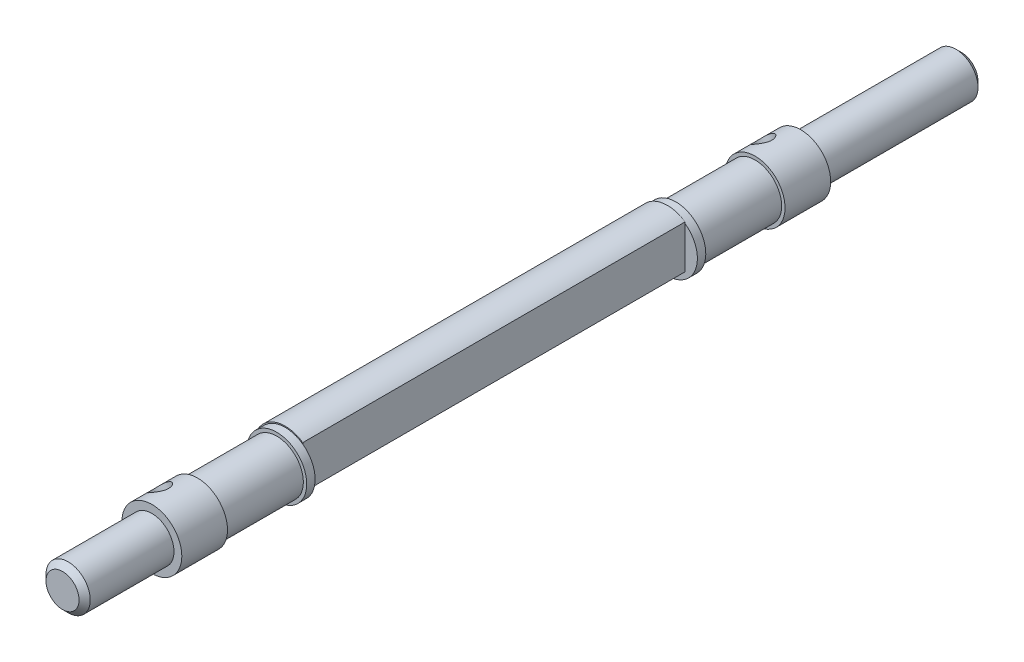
ISO-10303-21;
HEADER;
FILE_DESCRIPTION(('STEP AP214'),'2;1');
FILE_NAME('part.step','',(''),(''),'','','');
FILE_SCHEMA(('AUTOMOTIVE_DESIGN { 1 0 10303 214 1 1 1 1 }'));
ENDSEC;
DATA;
#1=APPLICATION_CONTEXT('core data for automotive mechanical design processes');
#2=APPLICATION_PROTOCOL_DEFINITION('international standard','automotive_design',2000,#1);
#3=PRODUCT_CONTEXT('',#1,'mechanical');
#4=PRODUCT('Part','Part','',(#3));
#5=PRODUCT_RELATED_PRODUCT_CATEGORY('part','',(#4));
#6=PRODUCT_DEFINITION_FORMATION('','',#4);
#7=PRODUCT_DEFINITION_CONTEXT('part definition',#1,'design');
#8=PRODUCT_DEFINITION('design','',#6,#7);
#9=PRODUCT_DEFINITION_SHAPE('','',#8);
#10=(LENGTH_UNIT() NAMED_UNIT(*) SI_UNIT(.MILLI.,.METRE.));
#11=(NAMED_UNIT(*) PLANE_ANGLE_UNIT() SI_UNIT($,.RADIAN.));
#12=(NAMED_UNIT(*) SI_UNIT($,.STERADIAN.) SOLID_ANGLE_UNIT());
#13=UNCERTAINTY_MEASURE_WITH_UNIT(LENGTH_MEASURE(1.E-05),#10,'distance_accuracy_value','');
#14=(GEOMETRIC_REPRESENTATION_CONTEXT(3) GLOBAL_UNCERTAINTY_ASSIGNED_CONTEXT((#13)) GLOBAL_UNIT_ASSIGNED_CONTEXT((#10,
#11,#12)) REPRESENTATION_CONTEXT('',''));
#15=CARTESIAN_POINT('',(0.,0.,0.));
#16=DIRECTION('',(0.,0.,1.));
#17=DIRECTION('',(1.,0.,0.));
#18=AXIS2_PLACEMENT_3D('',#15,#16,#17);
#19=CARTESIAN_POINT('',(-11.2332,-11.2332,81.));
#20=DIRECTION('',(0.,0.,1.));
#21=DIRECTION('',(1.,0.,0.));
#22=AXIS2_PLACEMENT_3D('',#19,#20,#21);
#23=PLANE('',#22);
#24=CARTESIAN_POINT('',(0.,0.,81.));
#25=DIRECTION('',(0.,0.,1.));
#26=DIRECTION('',(1.,0.,0.));
#27=AXIS2_PLACEMENT_3D('',#24,#25,#26);
#28=CIRCLE('',#27,10.7);
#29=CARTESIAN_POINT('',(-8.64869932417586,-6.3,81.));
#30=VERTEX_POINT('',#29);
#31=CARTESIAN_POINT('',(6.3,8.64869932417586,81.));
#32=VERTEX_POINT('',#31);
#33=EDGE_CURVE('E331',#30,#32,#28,.F.);
#34=ORIENTED_EDGE('',*,*,#33,.T.);
#35=DIRECTION('',(0.,-1.,0.));
#36=VECTOR('',#35,1.);
#37=CARTESIAN_POINT('',(6.3,15.819880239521,81.));
#38=LINE('',#37,#36);
#39=CARTESIAN_POINT('',(6.3,9.13892772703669,81.));
#40=VERTEX_POINT('',#39);
#41=EDGE_CURVE('E132',#40,#32,#38,.T.);
#42=ORIENTED_EDGE('',*,*,#41,.F.);
#43=CARTESIAN_POINT('',(0.,0.,81.));
#44=DIRECTION('',(0.,0.,-1.));
#45=DIRECTION('',(-1.,0.,0.));
#46=AXIS2_PLACEMENT_3D('',#43,#44,#45);
#47=CIRCLE('',#46,11.1);
#48=CARTESIAN_POINT('',(-9.13892772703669,-6.3,81.));
#49=VERTEX_POINT('',#48);
#50=EDGE_CURVE('E333',#40,#49,#47,.F.);
#51=ORIENTED_EDGE('',*,*,#50,.T.);
#52=DIRECTION('',(-1.,0.,0.));
#53=VECTOR('',#52,1.);
#54=CARTESIAN_POINT('',(6.3,-6.3,81.));
#55=LINE('',#54,#53);
#56=EDGE_CURVE('E137',#30,#49,#55,.T.);
#57=ORIENTED_EDGE('',*,*,#56,.F.);
#58=EDGE_LOOP('',(#34,#42,#51,#57));
#59=FACE_BOUND('',#58,.T.);
#60=ADVANCED_FACE('F41',(#59),#23,.T.);
#61=CARTESIAN_POINT('',(0.,0.,81.));
#62=DIRECTION('',(0.,0.,-1.));
#63=DIRECTION('',(-1.,0.,0.));
#64=AXIS2_PLACEMENT_3D('',#61,#62,#63);
#65=CYLINDRICAL_SURFACE('',#64,11.1);
#66=DIRECTION('',(0.,0.,-1.));
#67=VECTOR('',#66,1.);
#68=CARTESIAN_POINT('',(6.3,9.13892772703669,81.));
#69=LINE('',#68,#67);
#70=CARTESIAN_POINT('',(6.3,9.13892772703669,-55.5));
#71=VERTEX_POINT('',#70);
#72=EDGE_CURVE('E142',#71,#40,#69,.F.);
#73=ORIENTED_EDGE('',*,*,#72,.F.);
#74=CARTESIAN_POINT('',(0.,0.,-55.5));
#75=DIRECTION('',(0.,0.,-1.));
#76=DIRECTION('',(-1.,0.,0.));
#77=AXIS2_PLACEMENT_3D('',#74,#75,#76);
#78=CIRCLE('',#77,11.1);
#79=CARTESIAN_POINT('',(-9.13892772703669,-6.3,-55.5));
#80=VERTEX_POINT('',#79);
#81=EDGE_CURVE('E336',#80,#71,#78,.T.);
#82=ORIENTED_EDGE('',*,*,#81,.F.);
#83=DIRECTION('',(0.,0.,-1.));
#84=VECTOR('',#83,1.);
#85=CARTESIAN_POINT('',(-9.13892772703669,-6.3,81.));
#86=LINE('',#85,#84);
#87=EDGE_CURVE('E140',#49,#80,#86,.T.);
#88=ORIENTED_EDGE('',*,*,#87,.F.);
#89=ORIENTED_EDGE('',*,*,#50,.F.);
#90=EDGE_LOOP('',(#73,#82,#88,#89));
#91=FACE_BOUND('',#90,.T.);
#92=ADVANCED_FACE('F234',(#91),#65,.T.);
#93=CARTESIAN_POINT('',(11.2332,-11.2332,-55.5));
#94=DIRECTION('',(0.,0.,-1.));
#95=DIRECTION('',(-1.,0.,0.));
#96=AXIS2_PLACEMENT_3D('',#93,#94,#95);
#97=PLANE('',#96);
#98=ORIENTED_EDGE('',*,*,#81,.T.);
#99=DIRECTION('',(0.,-1.,0.));
#100=VECTOR('',#99,1.);
#101=CARTESIAN_POINT('',(6.3,15.819880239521,-55.5));
#102=LINE('',#101,#100);
#103=CARTESIAN_POINT('',(6.3,8.64869932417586,-55.5));
#104=VERTEX_POINT('',#103);
#105=EDGE_CURVE('E127',#71,#104,#102,.T.);
#106=ORIENTED_EDGE('',*,*,#105,.T.);
#107=CARTESIAN_POINT('',(0.,0.,-55.5));
#108=DIRECTION('',(0.,0.,-1.));
#109=DIRECTION('',(0.,1.,0.));
#110=AXIS2_PLACEMENT_3D('',#107,#108,#109);
#111=CIRCLE('',#110,10.7);
#112=CARTESIAN_POINT('',(-8.64869932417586,-6.3,-55.5));
#113=VERTEX_POINT('',#112);
#114=EDGE_CURVE('E339',#104,#113,#111,.F.);
#115=ORIENTED_EDGE('',*,*,#114,.T.);
#116=DIRECTION('',(-1.,0.,0.));
#117=VECTOR('',#116,1.);
#118=CARTESIAN_POINT('',(6.3,-6.3,-55.5));
#119=LINE('',#118,#117);
#120=EDGE_CURVE('E130',#113,#80,#119,.T.);
#121=ORIENTED_EDGE('',*,*,#120,.T.);
#122=EDGE_LOOP('',(#98,#106,#115,#121));
#123=FACE_BOUND('',#122,.T.);
#124=ADVANCED_FACE('F241',(#123),#97,.T.);
#125=CARTESIAN_POINT('',(0.,0.,112.3));
#126=DIRECTION('',(0.,0.,1.));
#127=DIRECTION('',(1.,0.,0.));
#128=AXIS2_PLACEMENT_3D('',#125,#126,#127);
#129=CYLINDRICAL_SURFACE('',#128,10.7);
#130=CARTESIAN_POINT('',(-8.01720753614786,7.08621078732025,120.45000000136));
#131=CARTESIAN_POINT('',(-8.01720712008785,7.08621157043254,120.542779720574));
#132=CARTESIAN_POINT('',(-8.01455246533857,7.08921896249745,120.63556517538));
#133=CARTESIAN_POINT('',(-8.00395107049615,7.10118428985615,120.820458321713));
#134=CARTESIAN_POINT('',(-7.99600218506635,7.11014463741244,120.912565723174));
#135=CARTESIAN_POINT('',(-7.9642128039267,7.14579737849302,121.187084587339));
#136=CARTESIAN_POINT('',(-7.93242960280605,7.18126122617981,121.367577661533));
#137=CARTESIAN_POINT('',(-7.84832169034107,7.27307684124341,121.717510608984));
#138=CARTESIAN_POINT('',(-7.79604652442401,7.32937820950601,121.886976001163));
#139=CARTESIAN_POINT('',(-7.6716353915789,7.45949653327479,122.211208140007));
#140=CARTESIAN_POINT('',(-7.59950186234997,7.53331133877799,122.36597668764));
#141=CARTESIAN_POINT('',(-7.43351200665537,7.69720098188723,122.661963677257));
#142=CARTESIAN_POINT('',(-7.33902833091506,7.78772465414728,122.8025816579));
#143=CARTESIAN_POINT('',(-7.13080570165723,7.97881913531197,123.060920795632));
#144=CARTESIAN_POINT('',(-7.01706296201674,8.07939191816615,123.178637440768));
#145=CARTESIAN_POINT('',(-6.76897529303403,8.28841677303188,123.390474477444));
#146=CARTESIAN_POINT('',(-6.63420993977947,8.39699827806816,123.48397709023));
#147=CARTESIAN_POINT('',(-6.34862680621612,8.61493723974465,123.640659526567));
#148=CARTESIAN_POINT('',(-6.197813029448,8.72429449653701,123.703846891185));
#149=CARTESIAN_POINT('',(-5.88875860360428,8.93568351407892,123.796101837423));
#150=CARTESIAN_POINT('',(-5.73090736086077,9.03783765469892,123.826191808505));
#151=CARTESIAN_POINT('',(-5.40791009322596,9.23473046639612,123.854640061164));
#152=CARTESIAN_POINT('',(-5.242765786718,9.32947086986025,123.853005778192));
#153=CARTESIAN_POINT('',(-4.91623765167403,9.50546188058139,123.818718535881));
#154=CARTESIAN_POINT('',(-4.7549299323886,9.58707323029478,123.787174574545));
#155=CARTESIAN_POINT('',(-4.43512043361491,9.73915180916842,123.695786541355));
#156=CARTESIAN_POINT('',(-4.27661885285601,9.80961825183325,123.635940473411));
#157=CARTESIAN_POINT('',(-3.96526354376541,9.93959387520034,123.488948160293));
#158=CARTESIAN_POINT('',(-3.81250521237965,9.99895503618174,123.401469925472));
#159=CARTESIAN_POINT('',(-3.51938507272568,10.1058549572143,123.201972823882));
#160=CARTESIAN_POINT('',(-3.37902580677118,10.1533912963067,123.089948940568));
#161=CARTESIAN_POINT('',(-3.10936553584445,10.239274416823,122.838878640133));
#162=CARTESIAN_POINT('',(-2.98079638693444,10.2771399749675,122.698879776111));
#163=CARTESIAN_POINT('',(-2.74641347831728,10.3422457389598,122.398716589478));
#164=CARTESIAN_POINT('',(-2.64061058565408,10.3694808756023,122.23854269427));
#165=CARTESIAN_POINT('',(-2.45491343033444,10.4150238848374,121.899788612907));
#166=CARTESIAN_POINT('',(-2.3753628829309,10.4332147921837,121.721001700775));
#167=CARTESIAN_POINT('',(-2.27986345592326,10.4543412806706,121.444535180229));
#168=CARTESIAN_POINT('',(-2.2520085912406,10.460355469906,121.351042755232));
#169=CARTESIAN_POINT('',(-2.20452729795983,10.4704660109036,121.161901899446));
#170=CARTESIAN_POINT('',(-2.18489707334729,10.4745632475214,121.066254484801));
#171=CARTESIAN_POINT('',(-2.15580959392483,10.4805857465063,120.884006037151));
#172=CARTESIAN_POINT('',(-2.14548006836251,10.4826983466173,120.797548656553));
#173=CARTESIAN_POINT('',(-2.13169223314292,10.4855108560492,120.624062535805));
#174=CARTESIAN_POINT('',(-2.12823395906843,10.4862107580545,120.5370337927));
#175=CARTESIAN_POINT('',(-2.12823567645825,10.4862108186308,120.357220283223));
#176=CARTESIAN_POINT('',(-2.13216748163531,10.4854155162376,120.264434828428));
#177=CARTESIAN_POINT('',(-2.14783045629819,10.4822171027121,120.079541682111));
#178=CARTESIAN_POINT('',(-2.15956478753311,10.479813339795,119.987434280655));
#179=CARTESIAN_POINT('',(-2.20633565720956,10.4701092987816,119.712915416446));
#180=CARTESIAN_POINT('',(-2.252939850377,10.4603161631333,119.532422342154));
#181=CARTESIAN_POINT('',(-2.3745084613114,10.4333843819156,119.182489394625));
#182=CARTESIAN_POINT('',(-2.44940445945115,10.4162634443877,119.013024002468));
#183=CARTESIAN_POINT('',(-2.62429579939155,10.3735794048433,118.688791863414));
#184=CARTESIAN_POINT('',(-2.7242880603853,10.3480173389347,118.534023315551));
#185=CARTESIAN_POINT('',(-2.94921558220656,10.2862107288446,118.238036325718));
#186=CARTESIAN_POINT('',(-3.07485321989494,10.2496473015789,118.097418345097));
#187=CARTESIAN_POINT('',(-3.34445720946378,10.1648684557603,117.839079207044));
#188=CARTESIAN_POINT('',(-3.48842716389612,10.1166507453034,117.721362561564));
#189=CARTESIAN_POINT('',(-3.79349183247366,10.0063129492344,117.509525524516));
#190=CARTESIAN_POINT('',(-3.95490885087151,9.9438934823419,117.416022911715));
#191=CARTESIAN_POINT('',(-4.28644109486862,9.80554071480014,117.259340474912));
#192=CARTESIAN_POINT('',(-4.45655414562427,9.72961078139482,117.196153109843));
#193=CARTESIAN_POINT('',(-4.79414961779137,9.56765630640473,117.103898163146));
#194=CARTESIAN_POINT('',(-4.9615433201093,9.48203019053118,117.073808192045));
#195=CARTESIAN_POINT('',(-5.29355613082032,9.30075275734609,117.045359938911));
#196=CARTESIAN_POINT('',(-5.45817588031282,9.20510379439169,117.046994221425));
#197=CARTESIAN_POINT('',(-5.77385263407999,9.01031763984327,117.081281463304));
#198=CARTESIAN_POINT('',(-5.92518399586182,8.91142673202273,117.112825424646));
#199=CARTESIAN_POINT('',(-6.21679265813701,8.71050287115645,117.204213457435));
#200=CARTESIAN_POINT('',(-6.35706917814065,8.60846969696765,117.264059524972));
#201=CARTESIAN_POINT('',(-6.62530902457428,8.40381590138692,117.411051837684));
#202=CARTESIAN_POINT('',(-6.75309646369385,8.30120388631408,117.498530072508));
#203=CARTESIAN_POINT('',(-6.9922345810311,8.10080435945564,117.698027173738));
#204=CARTESIAN_POINT('',(-7.10358189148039,8.00301783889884,117.81005105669));
#205=CARTESIAN_POINT('',(-7.3127889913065,7.81242675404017,118.061121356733));
#206=CARTESIAN_POINT('',(-7.40986610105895,7.72001538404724,118.201120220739));
#207=CARTESIAN_POINT('',(-7.58344080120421,7.54958671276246,118.501283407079));
#208=CARTESIAN_POINT('',(-7.65992856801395,7.47157628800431,118.661457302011));
#209=CARTESIAN_POINT('',(-7.79221854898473,7.33352933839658,119.000211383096));
#210=CARTESIAN_POINT('',(-7.8477476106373,7.27373199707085,119.178998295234));
#211=CARTESIAN_POINT('',(-7.91379340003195,7.2015903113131,119.455464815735));
#212=CARTESIAN_POINT('',(-7.93292927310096,7.18047438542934,119.548957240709));
#213=CARTESIAN_POINT('',(-7.96542590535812,7.14440964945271,119.738098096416));
#214=CARTESIAN_POINT('',(-7.97878932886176,7.12945799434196,119.833745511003));
#215=CARTESIAN_POINT('',(-7.99854870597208,7.10727874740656,120.01599395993));
#216=CARTESIAN_POINT('',(-8.00554303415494,7.0993894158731,120.102451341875));
#217=CARTESIAN_POINT('',(-8.01487265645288,7.08885505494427,120.275937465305));
#218=CARTESIAN_POINT('',(-8.01720792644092,7.08621005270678,120.362966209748));
#219=CARTESIAN_POINT('',(-8.01720753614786,7.08621078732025,120.45000000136));
#220=B_SPLINE_CURVE_WITH_KNOTS('',3,(#130,#131,#132,#133,#134,#135,#136,#137,#138,#139,#140,
#141,#142,#143,#144,#145,#146,#147,#148,#149,#150,#151,#152,#153,#154,#155,#156,#157,#158,#159,
#160,#161,#162,#163,#164,#165,#166,#167,#168,#169,#170,#171,#172,#173,#174,#175,#176,#177,#178,
#179,#180,#181,#182,#183,#184,#185,#186,#187,#188,#189,#190,#191,#192,#193,#194,#195,#196,#197,
#198,#199,#200,#201,#202,#203,#204,#205,#206,#207,#208,#209,#210,#211,#212,#213,#214,#215,#216,
#217,#218,#219),.UNSPECIFIED.,.T.,.F.,(4,2,2,2,2,2,2,2,2,2,2,2,2,2,2,2,2,2,2,2,2,2,2,2,2,2,2,2,
2,2,2,2,2,2,2,2,2,2,2,2,2,2,2,2,4),(0.,0.27825205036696,0.556616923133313,1.11368727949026,
1.66941897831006,2.22508248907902,2.79872517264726,3.37248075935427,3.95968527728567,
4.54674364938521,5.11510863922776,5.68334041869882,6.23129456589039,6.77928736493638,
7.33413195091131,7.88909003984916,8.46783511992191,9.04685584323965,9.63318173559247,
9.92608014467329,10.2188432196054,10.4798615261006,10.7408811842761,11.0191332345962,
11.2974981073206,11.8545684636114,12.4103001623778,12.9659636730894,13.5396063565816,
14.1133619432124,14.7005664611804,15.2876248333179,15.8559898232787,16.4242216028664,
16.9721757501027,17.5201685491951,18.0750131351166,18.6299712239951,19.2087163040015,
19.7877370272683,20.3740629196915,20.6669613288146,20.9597244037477,21.220742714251,
21.4817623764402),.UNSPECIFIED.);
#221=CARTESIAN_POINT('',(-8.01720753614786,7.08621078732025,120.45000000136));
#222=VERTEX_POINT('',#221);
#223=EDGE_CURVE('E162',#222,#222,#220,.T.);
#224=ORIENTED_EDGE('',*,*,#223,.F.);
#225=EDGE_LOOP('',(#224));
#226=FACE_BOUND('',#225,.T.);
#227=CARTESIAN_POINT('',(0.,0.,112.3));
#228=DIRECTION('',(0.,0.,1.));
#229=DIRECTION('',(1.,0.,0.));
#230=AXIS2_PLACEMENT_3D('',#227,#228,#229);
#231=CIRCLE('',#230,10.7);
#232=CARTESIAN_POINT('',(10.7,0.,112.3));
#233=VERTEX_POINT('',#232);
#234=EDGE_CURVE('E298',#233,#233,#231,.T.);
#235=ORIENTED_EDGE('',*,*,#234,.T.);
#236=EDGE_LOOP('',(#235));
#237=FACE_BOUND('',#236,.T.);
#238=CARTESIAN_POINT('',(0.,0.,128.6));
#239=DIRECTION('',(0.,0.,1.));
#240=DIRECTION('',(1.,0.,0.));
#241=AXIS2_PLACEMENT_3D('',#238,#239,#240);
#242=CIRCLE('',#241,10.7);
#243=CARTESIAN_POINT('',(10.7,0.,128.6));
#244=VERTEX_POINT('',#243);
#245=EDGE_CURVE('E149',#244,#244,#242,.T.);
#246=ORIENTED_EDGE('',*,*,#245,.F.);
#247=EDGE_LOOP('',(#246));
#248=FACE_BOUND('',#247,.T.);
#249=ADVANCED_FACE('F251',(#226,#237,#248),#129,.T.);
#250=CARTESIAN_POINT('',(0.,0.,-86.8));
#251=DIRECTION('',(0.,0.,-1.));
#252=DIRECTION('',(0.,1.,0.));
#253=AXIS2_PLACEMENT_3D('',#250,#251,#252);
#254=CYLINDRICAL_SURFACE('',#253,10.7);
#255=CARTESIAN_POINT('',(-2.12823479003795,10.4862107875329,-94.9500000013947));
#256=CARTESIAN_POINT('',(-2.12823567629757,10.4862108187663,-95.0427797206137));
#257=CARTESIAN_POINT('',(-2.13216748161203,10.4854155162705,-95.1355651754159));
#258=CARTESIAN_POINT('',(-2.14783045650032,10.4822171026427,-95.3204583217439));
#259=CARTESIAN_POINT('',(-2.15956478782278,10.4798133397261,-95.4125657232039));
#260=CARTESIAN_POINT('',(-2.20633565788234,10.4701092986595,-95.6870845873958));
#261=CARTESIAN_POINT('',(-2.25293985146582,10.4603161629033,-95.867577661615));
#262=CARTESIAN_POINT('',(-2.37450846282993,10.4333843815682,-96.2175106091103));
#263=CARTESIAN_POINT('',(-2.44940446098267,10.416263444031,-96.3869760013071));
#264=CARTESIAN_POINT('',(-2.62429580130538,10.3735794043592,-96.7112081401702));
#265=CARTESIAN_POINT('',(-2.72428806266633,10.3480173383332,-96.8659766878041));
#266=CARTESIAN_POINT('',(-2.94921558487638,10.286210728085,-97.1619636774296));
#267=CARTESIAN_POINT('',(-3.07485322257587,10.2496473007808,-97.3025816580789));
#268=CARTESIAN_POINT('',(-3.34445721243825,10.1648684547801,-97.5609207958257));
#269=CARTESIAN_POINT('',(-3.48842716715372,10.1166507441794,-97.6786374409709));
#270=CARTESIAN_POINT('',(-3.79349183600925,10.0063129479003,-97.89047447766));
#271=CARTESIAN_POINT('',(-3.95490885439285,9.94389348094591,-97.9839770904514));
#272=CARTESIAN_POINT('',(-4.28644109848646,9.805540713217,-98.1406595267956));
#273=CARTESIAN_POINT('',(-4.4565541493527,9.7296107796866,-98.2038468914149));
#274=CARTESIAN_POINT('',(-4.79414962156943,9.56765630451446,-98.2961018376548));
#275=CARTESIAN_POINT('',(-4.96154332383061,9.48203018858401,-98.3261918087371));
#276=CARTESIAN_POINT('',(-5.29355613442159,9.30075275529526,-98.3546400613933));
#277=CARTESIAN_POINT('',(-5.45817588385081,9.20510379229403,-98.3530057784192));
#278=CARTESIAN_POINT('',(-5.77385263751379,9.010317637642,-98.3187185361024));
#279=CARTESIAN_POINT('',(-5.92518399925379,8.9114267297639,-98.2871745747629));
#280=CARTESIAN_POINT('',(-6.21679266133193,8.71050286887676,-98.195786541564));
#281=CARTESIAN_POINT('',(-6.3570691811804,8.60846969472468,-98.1359404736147));
#282=CARTESIAN_POINT('',(-6.62530902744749,8.40381589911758,-97.9889481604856));
#283=CARTESIAN_POINT('',(-6.75309646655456,8.30120388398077,-97.9014699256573));
#284=CARTESIAN_POINT('',(-6.99223458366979,8.10080435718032,-97.7019728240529));
#285=CARTESIAN_POINT('',(-7.10358189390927,8.0030178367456,-97.5899489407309));
#286=CARTESIAN_POINT('',(-7.31278899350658,7.81242675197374,-97.3388786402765));
#287=CARTESIAN_POINT('',(-7.40986610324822,7.72001538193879,-97.198879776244));
#288=CARTESIAN_POINT('',(-7.58344080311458,7.54958671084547,-96.8987165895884));
#289=CARTESIAN_POINT('',(-7.65992856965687,7.47157628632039,-96.7385426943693));
#290=CARTESIAN_POINT('',(-7.79221855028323,7.33352933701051,-96.3997886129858));
#291=CARTESIAN_POINT('',(-7.8477476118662,7.27373199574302,-96.2210017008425));
#292=CARTESIAN_POINT('',(-7.91379340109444,7.20159031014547,-95.9445351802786));
#293=CARTESIAN_POINT('',(-7.93292927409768,7.1804743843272,-95.8510427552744));
#294=CARTESIAN_POINT('',(-7.96542590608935,7.14440964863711,-95.6619018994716));
#295=CARTESIAN_POINT('',(-7.97878932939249,7.12945799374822,-95.5662544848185));
#296=CARTESIAN_POINT('',(-7.99854870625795,7.10727874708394,-95.3840060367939));
#297=CARTESIAN_POINT('',(-8.0055430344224,7.0993894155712,-95.2975486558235));
#298=CARTESIAN_POINT('',(-8.01487265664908,7.08885505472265,-95.1240625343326));
#299=CARTESIAN_POINT('',(-8.01720792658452,7.08621005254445,-95.0370337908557));
#300=CARTESIAN_POINT('',(-8.01720712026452,7.08621157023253,-94.8572202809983));
#301=CARTESIAN_POINT('',(-8.0145524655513,7.08921896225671,-94.7644348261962));
#302=CARTESIAN_POINT('',(-8.00395107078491,7.10118428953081,-94.5795416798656));
#303=CARTESIAN_POINT('',(-7.99600218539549,7.11014463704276,-94.4874342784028));
#304=CARTESIAN_POINT('',(-7.96421280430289,7.14579737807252,-94.2129154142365));
#305=CARTESIAN_POINT('',(-7.93242960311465,7.18126122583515,-94.032422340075));
#306=CARTESIAN_POINT('',(-7.84832169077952,7.27307684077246,-93.6824893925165));
#307=CARTESIAN_POINT('',(-7.79604652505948,7.32937820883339,-93.5130240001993));
#308=CARTESIAN_POINT('',(-7.67163539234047,7.45949653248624,-93.1887918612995));
#309=CARTESIAN_POINT('',(-7.59950186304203,7.53331133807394,-93.0340233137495));
#310=CARTESIAN_POINT('',(-7.43351200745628,7.69720098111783,-92.7380363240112));
#311=CARTESIAN_POINT('',(-7.33902833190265,7.7877246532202,-92.597418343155));
#312=CARTESIAN_POINT('',(-7.13080570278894,7.97881913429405,-92.339079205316));
#313=CARTESIAN_POINT('',(-7.01706296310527,8.07939191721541,-92.2213625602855));
#314=CARTESIAN_POINT('',(-6.76897529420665,8.28841677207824,-92.0095255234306));
#315=CARTESIAN_POINT('',(-6.63420994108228,8.39699827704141,-91.9160229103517));
#316=CARTESIAN_POINT('',(-6.34862680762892,8.61493723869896,-91.7593404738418));
#317=CARTESIAN_POINT('',(-6.19781303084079,8.72429449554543,-91.6961531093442));
#318=CARTESIAN_POINT('',(-5.88875860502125,8.93568351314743,-91.6038981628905));
#319=CARTESIAN_POINT('',(-5.73090736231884,9.03783765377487,-91.573808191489));
#320=CARTESIAN_POINT('',(-5.40791009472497,9.23473046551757,-91.545359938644));
#321=CARTESIAN_POINT('',(-5.24276578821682,9.32947086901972,-91.5469942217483));
#322=CARTESIAN_POINT('',(-4.91623765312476,9.50546187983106,-91.5812814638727));
#323=CARTESIAN_POINT('',(-4.7549299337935,9.58707322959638,-91.6128254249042));
#324=CARTESIAN_POINT('',(-4.43512043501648,9.73915180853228,-91.7042134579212));
#325=CARTESIAN_POINT('',(-4.27661885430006,9.80961825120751,-91.7640595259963));
#326=CARTESIAN_POINT('',(-3.96526354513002,9.93959387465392,-91.9110518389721));
#327=CARTESIAN_POINT('',(-3.81250521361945,9.99895503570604,-91.9985300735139));
#328=CARTESIAN_POINT('',(-3.51938507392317,10.1058549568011,-92.1980271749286));
#329=CARTESIAN_POINT('',(-3.37902580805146,10.1533912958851,-92.3100510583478));
#330=CARTESIAN_POINT('',(-3.1093655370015,10.2392744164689,-92.5611213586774));
#331=CARTESIAN_POINT('',(-2.98079638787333,10.2771399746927,-92.701120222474));
#332=CARTESIAN_POINT('',(-2.74641347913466,10.3422457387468,-93.0012834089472));
#333=CARTESIAN_POINT('',(-2.64061058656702,10.3694808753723,-93.1614573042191));
#334=CARTESIAN_POINT('',(-2.4549134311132,10.4150238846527,-93.5002113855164));
#335=CARTESIAN_POINT('',(-2.37536288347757,10.4332147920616,-93.6789982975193));
#336=CARTESIAN_POINT('',(-2.27986345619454,10.4543412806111,-93.9554648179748));
#337=CARTESIAN_POINT('',(-2.25200859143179,10.4603554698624,-94.0489572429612));
#338=CARTESIAN_POINT('',(-2.2045272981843,10.4704660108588,-94.2380980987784));
#339=CARTESIAN_POINT('',(-2.18489707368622,10.4745632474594,-94.3337455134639));
#340=CARTESIAN_POINT('',(-2.1558095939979,10.4805857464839,-94.5159939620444));
#341=CARTESIAN_POINT('',(-2.14548006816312,10.4826983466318,-94.602451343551));
#342=CARTESIAN_POINT('',(-2.13169223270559,10.4855108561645,-94.7759374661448));
#343=CARTESIAN_POINT('',(-2.12823395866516,10.4862107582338,-94.8629662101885));
#344=CARTESIAN_POINT('',(-2.12823479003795,10.4862107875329,-94.9500000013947));
#345=B_SPLINE_CURVE_WITH_KNOTS('',3,(#255,#256,#257,#258,#259,#260,#261,#262,#263,#264,#265,
#266,#267,#268,#269,#270,#271,#272,#273,#274,#275,#276,#277,#278,#279,#280,#281,#282,#283,#284,
#285,#286,#287,#288,#289,#290,#291,#292,#293,#294,#295,#296,#297,#298,#299,#300,#301,#302,#303,
#304,#305,#306,#307,#308,#309,#310,#311,#312,#313,#314,#315,#316,#317,#318,#319,#320,#321,#322,
#323,#324,#325,#326,#327,#328,#329,#330,#331,#332,#333,#334,#335,#336,#337,#338,#339,#340,#341,
#342,#343,#344),.UNSPECIFIED.,.T.,.F.,(4,2,2,2,2,2,2,2,2,2,2,2,2,2,2,2,2,2,2,2,2,2,2,2,2,2,2,2,
2,2,2,2,2,2,2,2,2,2,2,2,2,2,2,2,4),(0.,0.278252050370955,0.556616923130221,1.11368727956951,
1.66941897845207,2.22508248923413,2.79872517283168,3.37248075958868,3.95968527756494,
4.54674364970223,5.11510863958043,5.68334041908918,6.23129456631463,6.77928736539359,
7.33413195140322,7.88909004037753,8.46783512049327,9.04685584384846,9.63318173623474,
9.9260801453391,10.2188432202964,10.4798615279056,10.7408811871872,11.0191332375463,
11.2974981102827,11.854568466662,12.4103001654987,12.9659636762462,13.5396063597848,
14.1133619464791,14.7005664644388,15.2876248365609,15.8559898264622,16.4242216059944,
16.9721757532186,17.5201685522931,18.0750131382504,18.6299712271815,19.2087163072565,
19.7877370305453,20.3740629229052,20.6669613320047,20.9597244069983,21.2207427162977,
21.4817623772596),.UNSPECIFIED.);
#346=CARTESIAN_POINT('',(-2.12823479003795,10.4862107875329,-94.9500000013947));
#347=VERTEX_POINT('',#346);
#348=EDGE_CURVE('E157',#347,#347,#345,.T.);
#349=ORIENTED_EDGE('',*,*,#348,.F.);
#350=EDGE_LOOP('',(#349));
#351=FACE_BOUND('',#350,.T.);
#352=CARTESIAN_POINT('',(0.,0.,-86.8));
#353=DIRECTION('',(0.,0.,-1.));
#354=DIRECTION('',(0.,1.,0.));
#355=AXIS2_PLACEMENT_3D('',#352,#353,#354);
#356=CIRCLE('',#355,10.7);
#357=CARTESIAN_POINT('',(0.,10.7,-86.8));
#358=VERTEX_POINT('',#357);
#359=EDGE_CURVE('E158',#358,#358,#356,.F.);
#360=ORIENTED_EDGE('',*,*,#359,.F.);
#361=EDGE_LOOP('',(#360));
#362=FACE_BOUND('',#361,.T.);
#363=CARTESIAN_POINT('',(0.,0.,-103.1));
#364=DIRECTION('',(0.,0.,-1.));
#365=DIRECTION('',(-1.,0.,0.));
#366=AXIS2_PLACEMENT_3D('',#363,#364,#365);
#367=CIRCLE('',#366,10.7);
#368=CARTESIAN_POINT('',(-10.7,0.,-103.1));
#369=VERTEX_POINT('',#368);
#370=EDGE_CURVE('E153',#369,#369,#367,.T.);
#371=ORIENTED_EDGE('',*,*,#370,.F.);
#372=EDGE_LOOP('',(#371));
#373=FACE_BOUND('',#372,.T.);
#374=ADVANCED_FACE('F171',(#351,#362,#373),#254,.T.);
#375=CARTESIAN_POINT('',(0.971463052,-1.682623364,120.45));
#376=DIRECTION('',(-0.500000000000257,0.86602540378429,0.));
#377=DIRECTION('',(-0.86602540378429,-0.500000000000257,0.));
#378=AXIS2_PLACEMENT_3D('',#375,#376,#377);
#379=CONICAL_SURFACE('',#378,0.,1.02974425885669);
#380=CARTESIAN_POINT('',(0.97146305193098,-1.6826233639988,120.45));
#381=VERTEX_POINT('',#380);
#382=VERTEX_LOOP('',#381);
#383=FACE_BOUND('',#382,.T.);
#384=CARTESIAN_POINT('',(-0.0499999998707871,0.0866025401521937,120.45));
#385=DIRECTION('',(-0.50000000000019,0.866025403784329,0.));
#386=DIRECTION('',(-0.866025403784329,-0.500000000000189,0.));
#387=AXIS2_PLACEMENT_3D('',#384,#385,#386);
#388=CIRCLE('',#387,3.4000000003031);
#389=CARTESIAN_POINT('',(-2.994486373,-1.61339746,120.45));
#390=VERTEX_POINT('',#389);
#391=EDGE_CURVE('E159',#390,#390,#388,.F.);
#392=ORIENTED_EDGE('',*,*,#391,.F.);
#393=EDGE_LOOP('',(#392));
#394=FACE_BOUND('',#393,.T.);
#395=ADVANCED_FACE('F185',(#383,#394),#379,.F.);
#396=CARTESIAN_POINT('',(-0.0499999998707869,0.086602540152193,120.45));
#397=DIRECTION('',(-0.500000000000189,0.866025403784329,0.));
#398=DIRECTION('',(-0.866025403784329,-0.500000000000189,0.));
#399=AXIS2_PLACEMENT_3D('',#396,#397,#398);
#400=CYLINDRICAL_SURFACE('',#399,3.40000000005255);
#401=ORIENTED_EDGE('',*,*,#391,.T.);
#402=EDGE_LOOP('',(#401));
#403=FACE_BOUND('',#402,.T.);
#404=ORIENTED_EDGE('',*,*,#223,.T.);
#405=EDGE_LOOP('',(#404));
#406=FACE_BOUND('',#405,.T.);
#407=ADVANCED_FACE('F302',(#403,#406),#400,.F.);
#408=CARTESIAN_POINT('',(-10.8284,-10.8284,112.3));
#409=DIRECTION('',(0.,0.,1.));
#410=DIRECTION('',(1.,0.,0.));
#411=AXIS2_PLACEMENT_3D('',#408,#409,#410);
#412=PLANE('',#411);
#413=CARTESIAN_POINT('',(0.,0.,112.3));
#414=DIRECTION('',(0.,0.,1.));
#415=DIRECTION('',(1.,0.,0.));
#416=AXIS2_PLACEMENT_3D('',#413,#414,#415);
#417=CIRCLE('',#416,9.5);
#418=CARTESIAN_POINT('',(9.5,0.,112.3));
#419=VERTEX_POINT('',#418);
#420=EDGE_CURVE('E320',#419,#419,#417,.T.);
#421=ORIENTED_EDGE('',*,*,#420,.T.);
#422=EDGE_LOOP('',(#421));
#423=FACE_BOUND('',#422,.T.);
#424=ORIENTED_EDGE('',*,*,#234,.F.);
#425=EDGE_LOOP('',(#424));
#426=FACE_BOUND('',#425,.T.);
#427=ADVANCED_FACE('F306',(#423,#426),#412,.F.);
#428=CARTESIAN_POINT('',(0.,0.,84.));
#429=DIRECTION('',(0.,0.,1.));
#430=DIRECTION('',(1.,0.,0.));
#431=AXIS2_PLACEMENT_3D('',#428,#429,#430);
#432=CYLINDRICAL_SURFACE('',#431,9.5);
#433=CARTESIAN_POINT('',(0.,0.,84.));
#434=DIRECTION('',(0.,0.,1.));
#435=DIRECTION('',(1.,0.,0.));
#436=AXIS2_PLACEMENT_3D('',#433,#434,#435);
#437=CIRCLE('',#436,9.5);
#438=CARTESIAN_POINT('',(9.5,0.,84.));
#439=VERTEX_POINT('',#438);
#440=EDGE_CURVE('E324',#439,#439,#437,.F.);
#441=ORIENTED_EDGE('',*,*,#440,.F.);
#442=EDGE_LOOP('',(#441));
#443=FACE_BOUND('',#442,.T.);
#444=ORIENTED_EDGE('',*,*,#420,.F.);
#445=EDGE_LOOP('',(#444));
#446=FACE_BOUND('',#445,.T.);
#447=ADVANCED_FACE('F311',(#443,#446),#432,.T.);
#448=CARTESIAN_POINT('',(-10.8284,-10.8284,84.));
#449=DIRECTION('',(0.,0.,1.));
#450=DIRECTION('',(1.,0.,0.));
#451=AXIS2_PLACEMENT_3D('',#448,#449,#450);
#452=PLANE('',#451);
#453=ORIENTED_EDGE('',*,*,#440,.T.);
#454=EDGE_LOOP('',(#453));
#455=FACE_BOUND('',#454,.T.);
#456=CARTESIAN_POINT('',(0.,0.,84.));
#457=DIRECTION('',(0.,0.,1.));
#458=DIRECTION('',(1.,0.,0.));
#459=AXIS2_PLACEMENT_3D('',#456,#457,#458);
#460=CIRCLE('',#459,10.7);
#461=CARTESIAN_POINT('',(10.7,0.,84.));
#462=VERTEX_POINT('',#461);
#463=EDGE_CURVE('E326',#462,#462,#460,.T.);
#464=ORIENTED_EDGE('',*,*,#463,.T.);
#465=EDGE_LOOP('',(#464));
#466=FACE_BOUND('',#465,.T.);
#467=ADVANCED_FACE('F247',(#455,#466),#452,.T.);
#468=CARTESIAN_POINT('',(0.,0.,81.));
#469=DIRECTION('',(0.,0.,1.));
#470=DIRECTION('',(1.,0.,0.));
#471=AXIS2_PLACEMENT_3D('',#468,#469,#470);
#472=CYLINDRICAL_SURFACE('',#471,10.7);
#473=ORIENTED_EDGE('',*,*,#33,.F.);
#474=CARTESIAN_POINT('',(0.,0.,81.));
#475=DIRECTION('',(0.,0.,-1.));
#476=DIRECTION('',(-1.,0.,0.));
#477=AXIS2_PLACEMENT_3D('',#474,#475,#476);
#478=CIRCLE('',#477,10.7);
#479=EDGE_CURVE('E144',#32,#30,#478,.T.);
#480=ORIENTED_EDGE('',*,*,#479,.F.);
#481=EDGE_LOOP('',(#473,#480));
#482=FACE_BOUND('',#481,.T.);
#483=ORIENTED_EDGE('',*,*,#463,.F.);
#484=EDGE_LOOP('',(#483));
#485=FACE_BOUND('',#484,.T.);
#486=ADVANCED_FACE('F375',(#482,#485),#472,.T.);
#487=CARTESIAN_POINT('',(0.,0.,-55.5));
#488=DIRECTION('',(0.,0.,-1.));
#489=DIRECTION('',(0.,1.,0.));
#490=AXIS2_PLACEMENT_3D('',#487,#488,#489);
#491=CYLINDRICAL_SURFACE('',#490,10.7);
#492=EDGE_CURVE('E340',#113,#104,#111,.F.);
#493=ORIENTED_EDGE('',*,*,#492,.F.);
#494=ORIENTED_EDGE('',*,*,#114,.F.);
#495=EDGE_LOOP('',(#493,#494));
#496=FACE_BOUND('',#495,.T.);
#497=CARTESIAN_POINT('',(0.,0.,-58.5));
#498=DIRECTION('',(0.,0.,-1.));
#499=DIRECTION('',(0.,1.,0.));
#500=AXIS2_PLACEMENT_3D('',#497,#498,#499);
#501=CIRCLE('',#500,10.7);
#502=CARTESIAN_POINT('',(0.,10.7,-58.5));
#503=VERTEX_POINT('',#502);
#504=EDGE_CURVE('E342',#503,#503,#501,.T.);
#505=ORIENTED_EDGE('',*,*,#504,.F.);
#506=EDGE_LOOP('',(#505));
#507=FACE_BOUND('',#506,.T.);
#508=ADVANCED_FACE('F257',(#496,#507),#491,.T.);
#509=CARTESIAN_POINT('',(10.8284,-10.8284,-58.5));
#510=DIRECTION('',(0.,0.,-1.));
#511=DIRECTION('',(-1.,0.,0.));
#512=AXIS2_PLACEMENT_3D('',#509,#510,#511);
#513=PLANE('',#512);
#514=CARTESIAN_POINT('',(0.,0.,-58.5));
#515=DIRECTION('',(0.,0.,-1.));
#516=DIRECTION('',(0.,1.,0.));
#517=AXIS2_PLACEMENT_3D('',#514,#515,#516);
#518=CIRCLE('',#517,9.5);
#519=CARTESIAN_POINT('',(0.,9.5,-58.5));
#520=VERTEX_POINT('',#519);
#521=EDGE_CURVE('E345',#520,#520,#518,.F.);
#522=ORIENTED_EDGE('',*,*,#521,.T.);
#523=EDGE_LOOP('',(#522));
#524=FACE_BOUND('',#523,.T.);
#525=ORIENTED_EDGE('',*,*,#504,.T.);
#526=EDGE_LOOP('',(#525));
#527=FACE_BOUND('',#526,.T.);
#528=ADVANCED_FACE('F253',(#524,#527),#513,.T.);
#529=CARTESIAN_POINT('',(0.,0.,-58.5));
#530=DIRECTION('',(0.,0.,-1.));
#531=DIRECTION('',(0.,1.,0.));
#532=AXIS2_PLACEMENT_3D('',#529,#530,#531);
#533=CYLINDRICAL_SURFACE('',#532,9.5);
#534=CARTESIAN_POINT('',(0.,0.,-86.8));
#535=DIRECTION('',(0.,0.,-1.));
#536=DIRECTION('',(0.,1.,0.));
#537=AXIS2_PLACEMENT_3D('',#534,#535,#536);
#538=CIRCLE('',#537,9.5);
#539=CARTESIAN_POINT('',(0.,9.50000000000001,-86.8));
#540=VERTEX_POINT('',#539);
#541=EDGE_CURVE('E347',#540,#540,#538,.F.);
#542=ORIENTED_EDGE('',*,*,#541,.T.);
#543=EDGE_LOOP('',(#542));
#544=FACE_BOUND('',#543,.T.);
#545=ORIENTED_EDGE('',*,*,#521,.F.);
#546=EDGE_LOOP('',(#545));
#547=FACE_BOUND('',#546,.T.);
#548=ADVANCED_FACE('F256',(#544,#547),#533,.T.);
#549=CARTESIAN_POINT('',(10.8284,-10.8284,-86.8));
#550=DIRECTION('',(0.,0.,-1.));
#551=DIRECTION('',(-1.,0.,0.));
#552=AXIS2_PLACEMENT_3D('',#549,#550,#551);
#553=PLANE('',#552);
#554=ORIENTED_EDGE('',*,*,#541,.F.);
#555=EDGE_LOOP('',(#554));
#556=FACE_BOUND('',#555,.T.);
#557=ORIENTED_EDGE('',*,*,#359,.T.);
#558=EDGE_LOOP('',(#557));
#559=FACE_BOUND('',#558,.T.);
#560=ADVANCED_FACE('F262',(#556,#559),#553,.F.);
#561=CARTESIAN_POINT('',(0.971463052,-1.682623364,-94.95));
#562=DIRECTION('',(-0.500000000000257,0.86602540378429,0.));
#563=DIRECTION('',(-0.86602540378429,-0.500000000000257,0.));
#564=AXIS2_PLACEMENT_3D('',#561,#562,#563);
#565=CONICAL_SURFACE('',#564,0.,1.02974425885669);
#566=CARTESIAN_POINT('',(0.97146305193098,-1.6826233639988,-94.95));
#567=VERTEX_POINT('',#566);
#568=VERTEX_LOOP('',#567);
#569=FACE_BOUND('',#568,.T.);
#570=CARTESIAN_POINT('',(-0.0499999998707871,0.0866025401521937,-94.95));
#571=DIRECTION('',(-0.50000000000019,0.866025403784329,0.));
#572=DIRECTION('',(-0.866025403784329,-0.500000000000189,0.));
#573=AXIS2_PLACEMENT_3D('',#570,#571,#572);
#574=CIRCLE('',#573,3.4000000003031);
#575=CARTESIAN_POINT('',(-2.994486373,-1.61339746,-94.95));
#576=VERTEX_POINT('',#575);
#577=EDGE_CURVE('E154',#576,#576,#574,.F.);
#578=ORIENTED_EDGE('',*,*,#577,.F.);
#579=EDGE_LOOP('',(#578));
#580=FACE_BOUND('',#579,.T.);
#581=ADVANCED_FACE('F179',(#569,#580),#565,.F.);
#582=CARTESIAN_POINT('',(-0.0499999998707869,0.086602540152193,-94.95));
#583=DIRECTION('',(-0.500000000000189,0.866025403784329,0.));
#584=DIRECTION('',(-0.866025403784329,-0.500000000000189,0.));
#585=AXIS2_PLACEMENT_3D('',#582,#583,#584);
#586=CYLINDRICAL_SURFACE('',#585,3.40000000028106);
#587=ORIENTED_EDGE('',*,*,#348,.T.);
#588=EDGE_LOOP('',(#587));
#589=FACE_BOUND('',#588,.T.);
#590=ORIENTED_EDGE('',*,*,#577,.T.);
#591=EDGE_LOOP('',(#590));
#592=FACE_BOUND('',#591,.T.);
#593=ADVANCED_FACE('F174',(#589,#592),#586,.F.);
#594=CARTESIAN_POINT('',(0.,0.,-103.1));
#595=DIRECTION('',(0.,0.,-1.));
#596=DIRECTION('',(-1.,0.,0.));
#597=AXIS2_PLACEMENT_3D('',#594,#595,#596);
#598=PLANE('',#597);
#599=CARTESIAN_POINT('',(0.,0.,-103.1));
#600=DIRECTION('',(0.,0.,-1.));
#601=DIRECTION('',(-1.,0.,0.));
#602=AXIS2_PLACEMENT_3D('',#599,#600,#601);
#603=CIRCLE('',#602,7.9);
#604=CARTESIAN_POINT('',(-7.9,0.,-103.1));
#605=VERTEX_POINT('',#604);
#606=EDGE_CURVE('E150',#605,#605,#603,.T.);
#607=ORIENTED_EDGE('',*,*,#606,.F.);
#608=EDGE_LOOP('',(#607));
#609=FACE_BOUND('',#608,.T.);
#610=ORIENTED_EDGE('',*,*,#370,.T.);
#611=EDGE_LOOP('',(#610));
#612=FACE_BOUND('',#611,.T.);
#613=ADVANCED_FACE('F178',(#609,#612),#598,.T.);
#614=CARTESIAN_POINT('',(0.,0.,-103.1));
#615=DIRECTION('',(0.,0.,-1.));
#616=DIRECTION('',(-1.,0.,0.));
#617=AXIS2_PLACEMENT_3D('',#614,#615,#616);
#618=CYLINDRICAL_SURFACE('',#617,7.9);
#619=CARTESIAN_POINT('',(0.,0.,-158.5));
#620=DIRECTION('',(0.,0.,1.));
#621=DIRECTION('',(1.,0.,0.));
#622=AXIS2_PLACEMENT_3D('',#619,#620,#621);
#623=CIRCLE('',#622,7.9);
#624=CARTESIAN_POINT('',(7.9,0.,-158.5));
#625=VERTEX_POINT('',#624);
#626=EDGE_CURVE('E279',#625,#625,#623,.T.);
#627=ORIENTED_EDGE('',*,*,#626,.T.);
#628=EDGE_LOOP('',(#627));
#629=FACE_BOUND('',#628,.T.);
#630=ORIENTED_EDGE('',*,*,#606,.T.);
#631=EDGE_LOOP('',(#630));
#632=FACE_BOUND('',#631,.T.);
#633=ADVANCED_FACE('F183',(#629,#632),#618,.T.);
#634=CARTESIAN_POINT('',(-10.8284,-10.8284,-160.5));
#635=DIRECTION('',(0.,0.,1.));
#636=DIRECTION('',(1.,0.,0.));
#637=AXIS2_PLACEMENT_3D('',#634,#635,#636);
#638=PLANE('',#637);
#639=CARTESIAN_POINT('',(0.,0.,-160.5));
#640=DIRECTION('',(0.,0.,1.));
#641=DIRECTION('',(1.,0.,0.));
#642=AXIS2_PLACEMENT_3D('',#639,#640,#641);
#643=CIRCLE('',#642,5.89999999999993);
#644=CARTESIAN_POINT('',(5.89999999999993,0.,-160.5));
#645=VERTEX_POINT('',#644);
#646=EDGE_CURVE('E169',#645,#645,#643,.F.);
#647=ORIENTED_EDGE('',*,*,#646,.T.);
#648=EDGE_LOOP('',(#647));
#649=FACE_BOUND('',#648,.T.);
#650=ADVANCED_FACE('F188',(#649),#638,.F.);
#651=CARTESIAN_POINT('',(0.,0.,128.6));
#652=DIRECTION('',(0.,0.,1.));
#653=DIRECTION('',(1.,0.,0.));
#654=AXIS2_PLACEMENT_3D('',#651,#652,#653);
#655=PLANE('',#654);
#656=CARTESIAN_POINT('',(0.,0.,128.6));
#657=DIRECTION('',(0.,0.,1.));
#658=DIRECTION('',(1.,0.,0.));
#659=AXIS2_PLACEMENT_3D('',#656,#657,#658);
#660=CIRCLE('',#659,7.9);
#661=CARTESIAN_POINT('',(7.9,0.,128.6));
#662=VERTEX_POINT('',#661);
#663=EDGE_CURVE('E146',#662,#662,#660,.T.);
#664=ORIENTED_EDGE('',*,*,#663,.F.);
#665=EDGE_LOOP('',(#664));
#666=FACE_BOUND('',#665,.T.);
#667=ORIENTED_EDGE('',*,*,#245,.T.);
#668=EDGE_LOOP('',(#667));
#669=FACE_BOUND('',#668,.T.);
#670=ADVANCED_FACE('F190',(#666,#669),#655,.T.);
#671=CARTESIAN_POINT('',(0.,0.,128.6));
#672=DIRECTION('',(0.,0.,1.));
#673=DIRECTION('',(1.,0.,0.));
#674=AXIS2_PLACEMENT_3D('',#671,#672,#673);
#675=CYLINDRICAL_SURFACE('',#674,7.9);
#676=CARTESIAN_POINT('',(0.,0.,158.5));
#677=DIRECTION('',(0.,0.,1.));
#678=DIRECTION('',(1.,0.,0.));
#679=AXIS2_PLACEMENT_3D('',#676,#677,#678);
#680=CIRCLE('',#679,7.9);
#681=CARTESIAN_POINT('',(7.9,0.,158.5));
#682=VERTEX_POINT('',#681);
#683=EDGE_CURVE('E12',#682,#682,#680,.F.);
#684=ORIENTED_EDGE('',*,*,#683,.T.);
#685=EDGE_LOOP('',(#684));
#686=FACE_BOUND('',#685,.T.);
#687=ORIENTED_EDGE('',*,*,#663,.T.);
#688=EDGE_LOOP('',(#687));
#689=FACE_BOUND('',#688,.T.);
#690=ADVANCED_FACE('F193',(#686,#689),#675,.T.);
#691=CARTESIAN_POINT('',(-10.8284,-10.8284,160.5));
#692=DIRECTION('',(0.,0.,1.));
#693=DIRECTION('',(1.,0.,0.));
#694=AXIS2_PLACEMENT_3D('',#691,#692,#693);
#695=PLANE('',#694);
#696=CARTESIAN_POINT('',(0.,0.,160.5));
#697=DIRECTION('',(0.,0.,1.));
#698=DIRECTION('',(1.,0.,0.));
#699=AXIS2_PLACEMENT_3D('',#696,#697,#698);
#700=CIRCLE('',#699,5.89999999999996);
#701=CARTESIAN_POINT('',(5.89999999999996,0.,160.5));
#702=VERTEX_POINT('',#701);
#703=EDGE_CURVE('E49',#702,#702,#700,.T.);
#704=ORIENTED_EDGE('',*,*,#703,.T.);
#705=EDGE_LOOP('',(#704));
#706=FACE_BOUND('',#705,.T.);
#707=ADVANCED_FACE('F197',(#706),#695,.T.);
#708=CARTESIAN_POINT('',(0.,0.,-160.5));
#709=DIRECTION('',(0.,0.,1.));
#710=DIRECTION('',(1.,0.,0.));
#711=AXIS2_PLACEMENT_3D('',#708,#709,#710);
#712=CONICAL_SURFACE('',#711,5.89999999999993,0.785398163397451);
#713=ORIENTED_EDGE('',*,*,#626,.F.);
#714=EDGE_LOOP('',(#713));
#715=FACE_BOUND('',#714,.T.);
#716=ORIENTED_EDGE('',*,*,#646,.F.);
#717=EDGE_LOOP('',(#716));
#718=FACE_BOUND('',#717,.T.);
#719=ADVANCED_FACE('F265',(#715,#718),#712,.T.);
#720=CARTESIAN_POINT('',(0.,0.,160.5));
#721=DIRECTION('',(0.,0.,-1.));
#722=DIRECTION('',(-1.,0.,0.));
#723=AXIS2_PLACEMENT_3D('',#720,#721,#722);
#724=CONICAL_SURFACE('',#723,5.89999999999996,0.785398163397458);
#725=ORIENTED_EDGE('',*,*,#683,.F.);
#726=EDGE_LOOP('',(#725));
#727=FACE_BOUND('',#726,.T.);
#728=ORIENTED_EDGE('',*,*,#703,.F.);
#729=EDGE_LOOP('',(#728));
#730=FACE_BOUND('',#729,.T.);
#731=ADVANCED_FACE('F43',(#727,#730),#724,.T.);
#732=CARTESIAN_POINT('',(0.,0.,81.));
#733=DIRECTION('',(0.,0.,-1.));
#734=DIRECTION('',(-1.,0.,0.));
#735=AXIS2_PLACEMENT_3D('',#732,#733,#734);
#736=PLANE('',#735);
#737=ORIENTED_EDGE('',*,*,#479,.T.);
#738=CARTESIAN_POINT('',(6.3,-6.3,81.));
#739=VERTEX_POINT('',#738);
#740=EDGE_CURVE('E133',#739,#30,#55,.T.);
#741=ORIENTED_EDGE('',*,*,#740,.F.);
#742=EDGE_CURVE('E129',#32,#739,#38,.T.);
#743=ORIENTED_EDGE('',*,*,#742,.F.);
#744=EDGE_LOOP('',(#737,#741,#743));
#745=FACE_BOUND('',#744,.T.);
#746=ADVANCED_FACE('F203',(#745),#736,.T.);
#747=CARTESIAN_POINT('',(6.3,15.819880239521,81.));
#748=DIRECTION('',(1.,0.,0.));
#749=DIRECTION('',(0.,1.,0.));
#750=AXIS2_PLACEMENT_3D('',#747,#748,#749);
#751=PLANE('',#750);
#752=ORIENTED_EDGE('',*,*,#72,.T.);
#753=ORIENTED_EDGE('',*,*,#41,.T.);
#754=ORIENTED_EDGE('',*,*,#742,.T.);
#755=DIRECTION('',(0.,0.,-1.));
#756=VECTOR('',#755,1.);
#757=CARTESIAN_POINT('',(6.3,-6.3,81.));
#758=LINE('',#757,#756);
#759=CARTESIAN_POINT('',(6.3,-6.3,-55.5));
#760=VERTEX_POINT('',#759);
#761=EDGE_CURVE('E136',#739,#760,#758,.T.);
#762=ORIENTED_EDGE('',*,*,#761,.T.);
#763=EDGE_CURVE('E125',#104,#760,#102,.T.);
#764=ORIENTED_EDGE('',*,*,#763,.F.);
#765=ORIENTED_EDGE('',*,*,#105,.F.);
#766=EDGE_LOOP('',(#752,#753,#754,#762,#764,#765));
#767=FACE_BOUND('',#766,.T.);
#768=ADVANCED_FACE('F199',(#767),#751,.T.);
#769=CARTESIAN_POINT('',(6.3,-6.3,81.));
#770=DIRECTION('',(0.,-1.,0.));
#771=DIRECTION('',(1.,0.,0.));
#772=AXIS2_PLACEMENT_3D('',#769,#770,#771);
#773=PLANE('',#772);
#774=CARTESIAN_POINT('',(-1.17434966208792,-6.3,62.75));
#775=DIRECTION('',(0.,-1.,0.));
#776=DIRECTION('',(0.,0.,-1.));
#777=AXIS2_PLACEMENT_3D('',#774,#775,#776);
#778=CIRCLE('',#777,3.4);
#779=CARTESIAN_POINT('',(-1.17434966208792,-6.3,59.35));
#780=VERTEX_POINT('',#779);
#781=EDGE_CURVE('E109',#780,#780,#778,.T.);
#782=ORIENTED_EDGE('',*,*,#781,.F.);
#783=EDGE_LOOP('',(#782));
#784=FACE_BOUND('',#783,.T.);
#785=CARTESIAN_POINT('',(-1.17434966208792,-6.3,12.75));
#786=DIRECTION('',(0.,-1.,0.));
#787=DIRECTION('',(0.,0.,-1.));
#788=AXIS2_PLACEMENT_3D('',#785,#786,#787);
#789=CIRCLE('',#788,3.4);
#790=CARTESIAN_POINT('',(-1.17434966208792,-6.3,9.35));
#791=VERTEX_POINT('',#790);
#792=EDGE_CURVE('E108',#791,#791,#789,.T.);
#793=ORIENTED_EDGE('',*,*,#792,.F.);
#794=EDGE_LOOP('',(#793));
#795=FACE_BOUND('',#794,.T.);
#796=CARTESIAN_POINT('',(-1.17434966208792,-6.3,-37.25));
#797=DIRECTION('',(0.,-1.,0.));
#798=DIRECTION('',(0.,0.,-1.));
#799=AXIS2_PLACEMENT_3D('',#796,#797,#798);
#800=CIRCLE('',#799,3.4);
#801=CARTESIAN_POINT('',(-1.17434966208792,-6.3,-40.65));
#802=VERTEX_POINT('',#801);
#803=EDGE_CURVE('E119',#802,#802,#800,.T.);
#804=ORIENTED_EDGE('',*,*,#803,.F.);
#805=EDGE_LOOP('',(#804));
#806=FACE_BOUND('',#805,.T.);
#807=ORIENTED_EDGE('',*,*,#87,.T.);
#808=ORIENTED_EDGE('',*,*,#120,.F.);
#809=EDGE_CURVE('E56',#760,#113,#119,.T.);
#810=ORIENTED_EDGE('',*,*,#809,.F.);
#811=ORIENTED_EDGE('',*,*,#761,.F.);
#812=ORIENTED_EDGE('',*,*,#740,.T.);
#813=ORIENTED_EDGE('',*,*,#56,.T.);
#814=EDGE_LOOP('',(#807,#808,#810,#811,#812,#813));
#815=FACE_BOUND('',#814,.T.);
#816=ADVANCED_FACE('F202',(#784,#795,#806,#815),#773,.T.);
#817=CARTESIAN_POINT('',(0.,0.,-55.5));
#818=DIRECTION('',(0.,0.,-1.));
#819=DIRECTION('',(-1.,0.,0.));
#820=AXIS2_PLACEMENT_3D('',#817,#818,#819);
#821=PLANE('',#820);
#822=ORIENTED_EDGE('',*,*,#763,.T.);
#823=ORIENTED_EDGE('',*,*,#809,.T.);
#824=ORIENTED_EDGE('',*,*,#492,.T.);
#825=EDGE_LOOP('',(#822,#823,#824));
#826=FACE_BOUND('',#825,.T.);
#827=ADVANCED_FACE('F207',(#826),#821,.F.);
#828=CARTESIAN_POINT('',(-1.17434966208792,7.95,-37.25));
#829=DIRECTION('',(0.,-1.,0.));
#830=DIRECTION('',(0.,0.,-1.));
#831=AXIS2_PLACEMENT_3D('',#828,#829,#830);
#832=CONICAL_SURFACE('',#831,3.4,1.02974425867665);
#833=CARTESIAN_POINT('',(-1.17434966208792,9.99292610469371,-37.25));
#834=VERTEX_POINT('',#833);
#835=VERTEX_LOOP('',#834);
#836=FACE_BOUND('',#835,.T.);
#837=CARTESIAN_POINT('',(-1.17434966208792,7.95,-37.25));
#838=DIRECTION('',(0.,-1.,0.));
#839=DIRECTION('',(0.,0.,-1.));
#840=AXIS2_PLACEMENT_3D('',#837,#838,#839);
#841=CIRCLE('',#840,3.4);
#842=CARTESIAN_POINT('',(-1.17434966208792,7.95,-40.65));
#843=VERTEX_POINT('',#842);
#844=EDGE_CURVE('E122',#843,#843,#841,.T.);
#845=ORIENTED_EDGE('',*,*,#844,.T.);
#846=EDGE_LOOP('',(#845));
#847=FACE_BOUND('',#846,.T.);
#848=ADVANCED_FACE('F214',(#836,#847),#832,.F.);
#849=CARTESIAN_POINT('',(-1.17434966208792,-6.3,-37.25));
#850=DIRECTION('',(0.,-1.,0.));
#851=DIRECTION('',(0.,0.,-1.));
#852=AXIS2_PLACEMENT_3D('',#849,#850,#851);
#853=CYLINDRICAL_SURFACE('',#852,3.4);
#854=ORIENTED_EDGE('',*,*,#844,.F.);
#855=EDGE_LOOP('',(#854));
#856=FACE_BOUND('',#855,.T.);
#857=ORIENTED_EDGE('',*,*,#803,.T.);
#858=EDGE_LOOP('',(#857));
#859=FACE_BOUND('',#858,.T.);
#860=ADVANCED_FACE('F217',(#856,#859),#853,.F.);
#861=CARTESIAN_POINT('',(-1.17434966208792,7.95,12.75));
#862=DIRECTION('',(0.,-1.,0.));
#863=DIRECTION('',(0.,0.,-1.));
#864=AXIS2_PLACEMENT_3D('',#861,#862,#863);
#865=CONICAL_SURFACE('',#864,3.4,1.02974425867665);
#866=CARTESIAN_POINT('',(-1.17434966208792,9.99292610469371,12.75));
#867=VERTEX_POINT('',#866);
#868=VERTEX_LOOP('',#867);
#869=FACE_BOUND('',#868,.T.);
#870=CARTESIAN_POINT('',(-1.17434966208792,7.95,12.75));
#871=DIRECTION('',(0.,-1.,0.));
#872=DIRECTION('',(0.,0.,-1.));
#873=AXIS2_PLACEMENT_3D('',#870,#871,#872);
#874=CIRCLE('',#873,3.4);
#875=CARTESIAN_POINT('',(-1.17434966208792,7.95,9.35));
#876=VERTEX_POINT('',#875);
#877=EDGE_CURVE('E112',#876,#876,#874,.T.);
#878=ORIENTED_EDGE('',*,*,#877,.T.);
#879=EDGE_LOOP('',(#878));
#880=FACE_BOUND('',#879,.T.);
#881=ADVANCED_FACE('F221',(#869,#880),#865,.F.);
#882=CARTESIAN_POINT('',(-1.17434966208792,-6.3,12.75));
#883=DIRECTION('',(0.,-1.,0.));
#884=DIRECTION('',(0.,0.,-1.));
#885=AXIS2_PLACEMENT_3D('',#882,#883,#884);
#886=CYLINDRICAL_SURFACE('',#885,3.4);
#887=ORIENTED_EDGE('',*,*,#877,.F.);
#888=EDGE_LOOP('',(#887));
#889=FACE_BOUND('',#888,.T.);
#890=ORIENTED_EDGE('',*,*,#792,.T.);
#891=EDGE_LOOP('',(#890));
#892=FACE_BOUND('',#891,.T.);
#893=ADVANCED_FACE('F102',(#889,#892),#886,.F.);
#894=CARTESIAN_POINT('',(-1.17434966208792,7.95,62.75));
#895=DIRECTION('',(0.,-1.,0.));
#896=DIRECTION('',(0.,0.,-1.));
#897=AXIS2_PLACEMENT_3D('',#894,#895,#896);
#898=CONICAL_SURFACE('',#897,3.4,1.02974425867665);
#899=CARTESIAN_POINT('',(-1.17434966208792,9.99292610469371,62.75));
#900=VERTEX_POINT('',#899);
#901=VERTEX_LOOP('',#900);
#902=FACE_BOUND('',#901,.T.);
#903=CARTESIAN_POINT('',(-1.17434966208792,7.95,62.75));
#904=DIRECTION('',(0.,-1.,0.));
#905=DIRECTION('',(0.,0.,-1.));
#906=AXIS2_PLACEMENT_3D('',#903,#904,#905);
#907=CIRCLE('',#906,3.4);
#908=CARTESIAN_POINT('',(-1.17434966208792,7.95,59.35));
#909=VERTEX_POINT('',#908);
#910=EDGE_CURVE('E106',#909,#909,#907,.T.);
#911=ORIENTED_EDGE('',*,*,#910,.T.);
#912=EDGE_LOOP('',(#911));
#913=FACE_BOUND('',#912,.T.);
#914=ADVANCED_FACE('F98',(#902,#913),#898,.F.);
#915=CARTESIAN_POINT('',(-1.17434966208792,-6.3,62.75));
#916=DIRECTION('',(0.,-1.,0.));
#917=DIRECTION('',(0.,0.,-1.));
#918=AXIS2_PLACEMENT_3D('',#915,#916,#917);
#919=CYLINDRICAL_SURFACE('',#918,3.4);
#920=ORIENTED_EDGE('',*,*,#910,.F.);
#921=EDGE_LOOP('',(#920));
#922=FACE_BOUND('',#921,.T.);
#923=ORIENTED_EDGE('',*,*,#781,.T.);
#924=EDGE_LOOP('',(#923));
#925=FACE_BOUND('',#924,.T.);
#926=ADVANCED_FACE('F101',(#922,#925),#919,.F.);
#927=CLOSED_SHELL('',(#60,#92,#124,#249,#374,#395,#407,#427,#447,#467,#486,#508,#528,#548,#560,
#581,#593,#613,#633,#650,#670,#690,#707,#719,#731,#746,#768,#816,#827,#848,#860,#881,#893,#914,#926));
#928=MANIFOLD_SOLID_BREP('B2',#927);
#929=ADVANCED_BREP_SHAPE_REPRESENTATION('',(#18,#928),#14);
#930=SHAPE_DEFINITION_REPRESENTATION(#9,#929);
ENDSEC;
END-ISO-10303-21;
